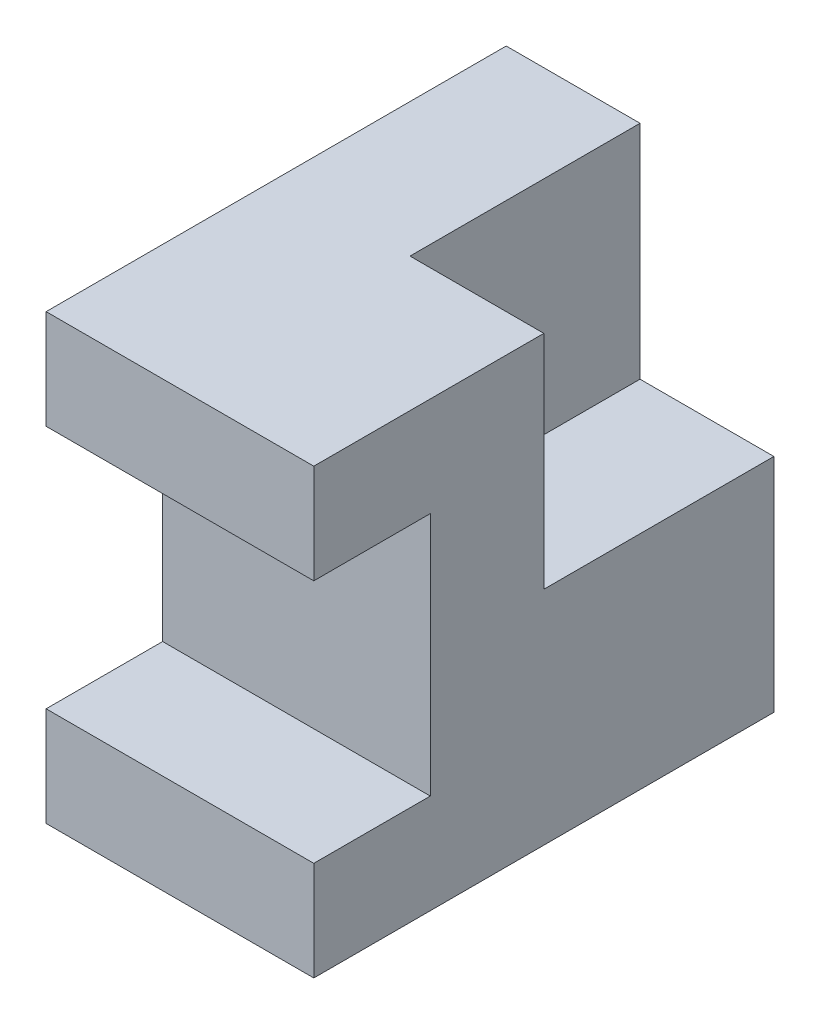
ISO-10303-21;
HEADER;
FILE_DESCRIPTION(('STEP AP214'),'2;1');
FILE_NAME('part.step','',(''),(''),'','','');
FILE_SCHEMA(('AUTOMOTIVE_DESIGN { 1 0 10303 214 1 1 1 1 }'));
ENDSEC;
DATA;
#1=APPLICATION_CONTEXT('core data for automotive mechanical design processes');
#2=APPLICATION_PROTOCOL_DEFINITION('international standard','automotive_design',2000,#1);
#3=PRODUCT_CONTEXT('',#1,'mechanical');
#4=PRODUCT('Part','Part','',(#3));
#5=PRODUCT_RELATED_PRODUCT_CATEGORY('part','',(#4));
#6=PRODUCT_DEFINITION_FORMATION('','',#4);
#7=PRODUCT_DEFINITION_CONTEXT('part definition',#1,'design');
#8=PRODUCT_DEFINITION('design','',#6,#7);
#9=PRODUCT_DEFINITION_SHAPE('','',#8);
#10=(LENGTH_UNIT() NAMED_UNIT(*) SI_UNIT(.MILLI.,.METRE.));
#11=(NAMED_UNIT(*) PLANE_ANGLE_UNIT() SI_UNIT($,.RADIAN.));
#12=(NAMED_UNIT(*) SI_UNIT($,.STERADIAN.) SOLID_ANGLE_UNIT());
#13=UNCERTAINTY_MEASURE_WITH_UNIT(LENGTH_MEASURE(1.E-05),#10,'distance_accuracy_value','');
#14=(GEOMETRIC_REPRESENTATION_CONTEXT(3) GLOBAL_UNCERTAINTY_ASSIGNED_CONTEXT((#13)) GLOBAL_UNIT_ASSIGNED_CONTEXT((#10,
#11,#12)) REPRESENTATION_CONTEXT('',''));
#15=CARTESIAN_POINT('',(0.,0.,0.));
#16=DIRECTION('',(0.,0.,1.));
#17=DIRECTION('',(1.,0.,0.));
#18=AXIS2_PLACEMENT_3D('',#15,#16,#17);
#19=CARTESIAN_POINT('',(-30.,24.8404474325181,13.0579168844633));
#20=DIRECTION('',(0.,1.,0.));
#21=DIRECTION('',(0.,0.,1.));
#22=AXIS2_PLACEMENT_3D('',#19,#20,#21);
#23=PLANE('',#22);
#24=DIRECTION('',(1.,0.,0.));
#25=VECTOR('',#24,1.);
#26=CARTESIAN_POINT('',(15.,24.8404474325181,-12.7256740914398));
#27=LINE('',#26,#25);
#28=CARTESIAN_POINT('',(-15.,24.8404474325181,-12.7256740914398));
#29=VERTEX_POINT('',#28);
#30=CARTESIAN_POINT('',(0.,24.8404474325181,-12.7256740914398));
#31=VERTEX_POINT('',#30);
#32=EDGE_CURVE('E185',#29,#31,#27,.T.);
#33=ORIENTED_EDGE('',*,*,#32,.F.);
#34=DIRECTION('',(0.,0.,1.));
#35=VECTOR('',#34,1.);
#36=CARTESIAN_POINT('',(-15.,24.8404474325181,-64.292856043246));
#37=LINE('',#36,#35);
#38=CARTESIAN_POINT('',(-15.,24.8404474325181,-38.5092650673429));
#39=VERTEX_POINT('',#38);
#40=EDGE_CURVE('E253',#39,#29,#37,.T.);
#41=ORIENTED_EDGE('',*,*,#40,.F.);
#42=DIRECTION('',(1.,0.,0.));
#43=VECTOR('',#42,1.);
#44=CARTESIAN_POINT('',(-30.,24.8404474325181,-38.5092650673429));
#45=LINE('',#44,#43);
#46=CARTESIAN_POINT('',(-30.,24.8404474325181,-38.5092650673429));
#47=VERTEX_POINT('',#46);
#48=EDGE_CURVE('E171',#47,#39,#45,.T.);
#49=ORIENTED_EDGE('',*,*,#48,.F.);
#50=DIRECTION('',(0.,0.,1.));
#51=VECTOR('',#50,1.);
#52=CARTESIAN_POINT('',(-30.,24.8404474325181,13.0579168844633));
#53=LINE('',#52,#51);
#54=CARTESIAN_POINT('',(-30.,24.8404474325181,13.0579168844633));
#55=VERTEX_POINT('',#54);
#56=EDGE_CURVE('E137',#47,#55,#53,.T.);
#57=ORIENTED_EDGE('',*,*,#56,.T.);
#58=DIRECTION('',(1.,0.,0.));
#59=VECTOR('',#58,1.);
#60=CARTESIAN_POINT('',(-30.,24.8404474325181,13.0579168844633));
#61=LINE('',#60,#59);
#62=CARTESIAN_POINT('',(0.,24.8404474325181,13.0579168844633));
#63=VERTEX_POINT('',#62);
#64=EDGE_CURVE('E168',#55,#63,#61,.T.);
#65=ORIENTED_EDGE('',*,*,#64,.T.);
#66=DIRECTION('',(0.,0.,1.));
#67=VECTOR('',#66,1.);
#68=CARTESIAN_POINT('',(0.,24.8404474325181,13.0579168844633));
#69=LINE('',#68,#67);
#70=EDGE_CURVE('E152',#31,#63,#69,.T.);
#71=ORIENTED_EDGE('',*,*,#70,.F.);
#72=EDGE_LOOP('',(#33,#41,#49,#57,#65,#71));
#73=FACE_BOUND('',#72,.T.);
#74=ADVANCED_FACE('F33',(#73),#23,.T.);
#75=CARTESIAN_POINT('',(-30.,-24.8404474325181,-38.5092650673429));
#76=DIRECTION('',(0.,0.,-1.));
#77=DIRECTION('',(0.,1.,0.));
#78=AXIS2_PLACEMENT_3D('',#75,#76,#77);
#79=PLANE('',#78);
#80=ORIENTED_EDGE('',*,*,#48,.T.);
#81=DIRECTION('',(0.,-1.,0.));
#82=VECTOR('',#81,1.);
#83=CARTESIAN_POINT('',(-15.,-24.8404474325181,-38.5092650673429));
#84=LINE('',#83,#82);
#85=CARTESIAN_POINT('',(-15.,0.,-38.5092650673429));
#86=VERTEX_POINT('',#85);
#87=EDGE_CURVE('E11',#39,#86,#84,.T.);
#88=ORIENTED_EDGE('',*,*,#87,.T.);
#89=DIRECTION('',(-1.,0.,0.));
#90=VECTOR('',#89,1.);
#91=CARTESIAN_POINT('',(-30.,0.,-38.5092650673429));
#92=LINE('',#91,#90);
#93=CARTESIAN_POINT('',(0.,0.,-38.5092650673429));
#94=VERTEX_POINT('',#93);
#95=EDGE_CURVE('E146',#94,#86,#92,.T.);
#96=ORIENTED_EDGE('',*,*,#95,.F.);
#97=DIRECTION('',(0.,1.,0.));
#98=VECTOR('',#97,1.);
#99=CARTESIAN_POINT('',(0.,-24.8404474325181,-38.5092650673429));
#100=LINE('',#99,#98);
#101=CARTESIAN_POINT('',(0.,-24.8404474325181,-38.5092650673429));
#102=VERTEX_POINT('',#101);
#103=EDGE_CURVE('E149',#102,#94,#100,.T.);
#104=ORIENTED_EDGE('',*,*,#103,.F.);
#105=DIRECTION('',(1.,0.,0.));
#106=VECTOR('',#105,1.);
#107=CARTESIAN_POINT('',(-30.,-24.8404474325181,-38.5092650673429));
#108=LINE('',#107,#106);
#109=CARTESIAN_POINT('',(-30.,-24.8404474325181,-38.5092650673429));
#110=VERTEX_POINT('',#109);
#111=EDGE_CURVE('E174',#110,#102,#108,.T.);
#112=ORIENTED_EDGE('',*,*,#111,.F.);
#113=DIRECTION('',(0.,1.,0.));
#114=VECTOR('',#113,1.);
#115=CARTESIAN_POINT('',(-30.,-24.8404474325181,-38.5092650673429));
#116=LINE('',#115,#114);
#117=EDGE_CURVE('E210',#110,#47,#116,.T.);
#118=ORIENTED_EDGE('',*,*,#117,.T.);
#119=EDGE_LOOP('',(#80,#88,#96,#104,#112,#118));
#120=FACE_BOUND('',#119,.T.);
#121=ADVANCED_FACE('F199',(#120),#79,.T.);
#122=CARTESIAN_POINT('',(0.,-13.7091045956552,13.0579168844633));
#123=DIRECTION('',(-1.,0.,0.));
#124=DIRECTION('',(0.,0.,1.));
#125=AXIS2_PLACEMENT_3D('',#122,#123,#124);
#126=PLANE('',#125);
#127=DIRECTION('',(0.,-1.,0.));
#128=VECTOR('',#127,1.);
#129=CARTESIAN_POINT('',(0.,-13.7091045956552,-12.7256740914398));
#130=LINE('',#129,#128);
#131=CARTESIAN_POINT('',(0.,0.,-12.7256740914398));
#132=VERTEX_POINT('',#131);
#133=EDGE_CURVE('E41',#31,#132,#130,.T.);
#134=ORIENTED_EDGE('',*,*,#133,.F.);
#135=ORIENTED_EDGE('',*,*,#70,.T.);
#136=DIRECTION('',(0.,-1.,0.));
#137=VECTOR('',#136,1.);
#138=CARTESIAN_POINT('',(0.,13.7091045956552,13.0579168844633));
#139=LINE('',#138,#137);
#140=CARTESIAN_POINT('',(0.,13.7091045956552,13.0579168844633));
#141=VERTEX_POINT('',#140);
#142=EDGE_CURVE('E154',#63,#141,#139,.T.);
#143=ORIENTED_EDGE('',*,*,#142,.T.);
#144=DIRECTION('',(0.,0.,-1.));
#145=VECTOR('',#144,1.);
#146=CARTESIAN_POINT('',(0.,13.7091045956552,13.0579168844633));
#147=LINE('',#146,#145);
#148=CARTESIAN_POINT('',(0.,13.7091045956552,0.));
#149=VERTEX_POINT('',#148);
#150=EDGE_CURVE('E157',#141,#149,#147,.T.);
#151=ORIENTED_EDGE('',*,*,#150,.T.);
#152=DIRECTION('',(0.,-1.,0.));
#153=VECTOR('',#152,1.);
#154=CARTESIAN_POINT('',(0.,-13.7091045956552,0.));
#155=LINE('',#154,#153);
#156=CARTESIAN_POINT('',(0.,-13.7091045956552,0.));
#157=VERTEX_POINT('',#156);
#158=EDGE_CURVE('E118',#149,#157,#155,.T.);
#159=ORIENTED_EDGE('',*,*,#158,.T.);
#160=DIRECTION('',(0.,0.,1.));
#161=VECTOR('',#160,1.);
#162=CARTESIAN_POINT('',(0.,-13.7091045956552,13.0579168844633));
#163=LINE('',#162,#161);
#164=CARTESIAN_POINT('',(0.,-13.7091045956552,13.0579168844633));
#165=VERTEX_POINT('',#164);
#166=EDGE_CURVE('E160',#157,#165,#163,.T.);
#167=ORIENTED_EDGE('',*,*,#166,.T.);
#168=DIRECTION('',(0.,-1.,0.));
#169=VECTOR('',#168,1.);
#170=CARTESIAN_POINT('',(0.,-24.8404474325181,13.0579168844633));
#171=LINE('',#170,#169);
#172=CARTESIAN_POINT('',(0.,-24.8404474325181,13.0579168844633));
#173=VERTEX_POINT('',#172);
#174=EDGE_CURVE('E142',#165,#173,#171,.T.);
#175=ORIENTED_EDGE('',*,*,#174,.T.);
#176=DIRECTION('',(0.,0.,-1.));
#177=VECTOR('',#176,1.);
#178=CARTESIAN_POINT('',(0.,-24.8404474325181,13.0579168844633));
#179=LINE('',#178,#177);
#180=EDGE_CURVE('E145',#173,#102,#179,.T.);
#181=ORIENTED_EDGE('',*,*,#180,.T.);
#182=ORIENTED_EDGE('',*,*,#103,.T.);
#183=DIRECTION('',(0.,0.,1.));
#184=VECTOR('',#183,1.);
#185=CARTESIAN_POINT('',(0.,0.,13.0579168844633));
#186=LINE('',#185,#184);
#187=EDGE_CURVE('E165',#94,#132,#186,.T.);
#188=ORIENTED_EDGE('',*,*,#187,.T.);
#189=EDGE_LOOP('',(#134,#135,#143,#151,#159,#167,#175,#181,#182,#188));
#190=FACE_BOUND('',#189,.T.);
#191=ADVANCED_FACE('F188',(#190),#126,.F.);
#192=CARTESIAN_POINT('',(-30.,-24.8404474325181,13.0579168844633));
#193=DIRECTION('',(0.,0.,1.));
#194=DIRECTION('',(1.,0.,0.));
#195=AXIS2_PLACEMENT_3D('',#192,#193,#194);
#196=PLANE('',#195);
#197=ORIENTED_EDGE('',*,*,#174,.F.);
#198=DIRECTION('',(1.,0.,0.));
#199=VECTOR('',#198,1.);
#200=CARTESIAN_POINT('',(-30.,-13.7091045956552,13.0579168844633));
#201=LINE('',#200,#199);
#202=CARTESIAN_POINT('',(-30.,-13.7091045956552,13.0579168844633));
#203=VERTEX_POINT('',#202);
#204=EDGE_CURVE('E57',#203,#165,#201,.T.);
#205=ORIENTED_EDGE('',*,*,#204,.F.);
#206=DIRECTION('',(0.,-1.,0.));
#207=VECTOR('',#206,1.);
#208=CARTESIAN_POINT('',(-30.,-24.8404474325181,13.0579168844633));
#209=LINE('',#208,#207);
#210=CARTESIAN_POINT('',(-30.,-24.8404474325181,13.0579168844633));
#211=VERTEX_POINT('',#210);
#212=EDGE_CURVE('E163',#203,#211,#209,.T.);
#213=ORIENTED_EDGE('',*,*,#212,.T.);
#214=DIRECTION('',(1.,0.,0.));
#215=VECTOR('',#214,1.);
#216=CARTESIAN_POINT('',(-30.,-24.8404474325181,13.0579168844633));
#217=LINE('',#216,#215);
#218=EDGE_CURVE('E93',#211,#173,#217,.T.);
#219=ORIENTED_EDGE('',*,*,#218,.T.);
#220=EDGE_LOOP('',(#197,#205,#213,#219));
#221=FACE_BOUND('',#220,.T.);
#222=ADVANCED_FACE('F35',(#221),#196,.T.);
#223=CARTESIAN_POINT('',(-30.,-13.7091045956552,13.0579168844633));
#224=DIRECTION('',(0.,1.,0.));
#225=DIRECTION('',(0.,0.,1.));
#226=AXIS2_PLACEMENT_3D('',#223,#224,#225);
#227=PLANE('',#226);
#228=ORIENTED_EDGE('',*,*,#166,.F.);
#229=DIRECTION('',(1.,0.,0.));
#230=VECTOR('',#229,1.);
#231=CARTESIAN_POINT('',(-30.,-13.7091045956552,0.));
#232=LINE('',#231,#230);
#233=CARTESIAN_POINT('',(-30.,-13.7091045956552,0.));
#234=VERTEX_POINT('',#233);
#235=EDGE_CURVE('E123',#234,#157,#232,.T.);
#236=ORIENTED_EDGE('',*,*,#235,.F.);
#237=DIRECTION('',(0.,0.,1.));
#238=VECTOR('',#237,1.);
#239=CARTESIAN_POINT('',(-30.,-13.7091045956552,13.0579168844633));
#240=LINE('',#239,#238);
#241=EDGE_CURVE('E132',#234,#203,#240,.T.);
#242=ORIENTED_EDGE('',*,*,#241,.T.);
#243=ORIENTED_EDGE('',*,*,#204,.T.);
#244=EDGE_LOOP('',(#228,#236,#242,#243));
#245=FACE_BOUND('',#244,.T.);
#246=ADVANCED_FACE('F219',(#245),#227,.T.);
#247=CARTESIAN_POINT('',(-30.,-13.7091045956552,0.));
#248=DIRECTION('',(0.,0.,1.));
#249=DIRECTION('',(1.,0.,0.));
#250=AXIS2_PLACEMENT_3D('',#247,#248,#249);
#251=PLANE('',#250);
#252=ORIENTED_EDGE('',*,*,#158,.F.);
#253=DIRECTION('',(1.,0.,0.));
#254=VECTOR('',#253,1.);
#255=CARTESIAN_POINT('',(-30.,13.7091045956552,0.));
#256=LINE('',#255,#254);
#257=CARTESIAN_POINT('',(-30.,13.7091045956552,0.));
#258=VERTEX_POINT('',#257);
#259=EDGE_CURVE('E112',#258,#149,#256,.T.);
#260=ORIENTED_EDGE('',*,*,#259,.F.);
#261=DIRECTION('',(0.,-1.,0.));
#262=VECTOR('',#261,1.);
#263=CARTESIAN_POINT('',(-30.,-13.7091045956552,0.));
#264=LINE('',#263,#262);
#265=EDGE_CURVE('E115',#258,#234,#264,.T.);
#266=ORIENTED_EDGE('',*,*,#265,.T.);
#267=ORIENTED_EDGE('',*,*,#235,.T.);
#268=EDGE_LOOP('',(#252,#260,#266,#267));
#269=FACE_BOUND('',#268,.T.);
#270=ADVANCED_FACE('F114',(#269),#251,.T.);
#271=CARTESIAN_POINT('',(-30.,13.7091045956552,13.0579168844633));
#272=DIRECTION('',(0.,-1.,0.));
#273=DIRECTION('',(0.,0.,-1.));
#274=AXIS2_PLACEMENT_3D('',#271,#272,#273);
#275=PLANE('',#274);
#276=ORIENTED_EDGE('',*,*,#150,.F.);
#277=DIRECTION('',(1.,0.,0.));
#278=VECTOR('',#277,1.);
#279=CARTESIAN_POINT('',(-30.,13.7091045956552,13.0579168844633));
#280=LINE('',#279,#278);
#281=CARTESIAN_POINT('',(-30.,13.7091045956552,13.0579168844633));
#282=VERTEX_POINT('',#281);
#283=EDGE_CURVE('E124',#282,#141,#280,.T.);
#284=ORIENTED_EDGE('',*,*,#283,.F.);
#285=DIRECTION('',(0.,0.,-1.));
#286=VECTOR('',#285,1.);
#287=CARTESIAN_POINT('',(-30.,13.7091045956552,13.0579168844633));
#288=LINE('',#287,#286);
#289=EDGE_CURVE('E130',#282,#258,#288,.T.);
#290=ORIENTED_EDGE('',*,*,#289,.T.);
#291=ORIENTED_EDGE('',*,*,#259,.T.);
#292=EDGE_LOOP('',(#276,#284,#290,#291));
#293=FACE_BOUND('',#292,.T.);
#294=ADVANCED_FACE('F134',(#293),#275,.T.);
#295=CARTESIAN_POINT('',(-30.,13.7091045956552,13.0579168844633));
#296=DIRECTION('',(0.,0.,1.));
#297=DIRECTION('',(1.,0.,0.));
#298=AXIS2_PLACEMENT_3D('',#295,#296,#297);
#299=PLANE('',#298);
#300=ORIENTED_EDGE('',*,*,#142,.F.);
#301=ORIENTED_EDGE('',*,*,#64,.F.);
#302=DIRECTION('',(0.,-1.,0.));
#303=VECTOR('',#302,1.);
#304=CARTESIAN_POINT('',(-30.,13.7091045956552,13.0579168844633));
#305=LINE('',#304,#303);
#306=EDGE_CURVE('E135',#55,#282,#305,.T.);
#307=ORIENTED_EDGE('',*,*,#306,.T.);
#308=ORIENTED_EDGE('',*,*,#283,.T.);
#309=EDGE_LOOP('',(#300,#301,#307,#308));
#310=FACE_BOUND('',#309,.T.);
#311=ADVANCED_FACE('F235',(#310),#299,.T.);
#312=CARTESIAN_POINT('',(-30.,-24.8404474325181,13.0579168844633));
#313=DIRECTION('',(0.,-1.,0.));
#314=DIRECTION('',(0.,0.,-1.));
#315=AXIS2_PLACEMENT_3D('',#312,#313,#314);
#316=PLANE('',#315);
#317=ORIENTED_EDGE('',*,*,#180,.F.);
#318=ORIENTED_EDGE('',*,*,#218,.F.);
#319=DIRECTION('',(0.,0.,-1.));
#320=VECTOR('',#319,1.);
#321=CARTESIAN_POINT('',(-30.,-24.8404474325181,13.0579168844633));
#322=LINE('',#321,#320);
#323=EDGE_CURVE('E208',#211,#110,#322,.T.);
#324=ORIENTED_EDGE('',*,*,#323,.T.);
#325=ORIENTED_EDGE('',*,*,#111,.T.);
#326=EDGE_LOOP('',(#317,#318,#324,#325));
#327=FACE_BOUND('',#326,.T.);
#328=ADVANCED_FACE('F218',(#327),#316,.T.);
#329=CARTESIAN_POINT('',(-30.,-13.7091045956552,13.0579168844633));
#330=DIRECTION('',(-1.,0.,0.));
#331=DIRECTION('',(0.,0.,1.));
#332=AXIS2_PLACEMENT_3D('',#329,#330,#331);
#333=PLANE('',#332);
#334=ORIENTED_EDGE('',*,*,#212,.F.);
#335=ORIENTED_EDGE('',*,*,#241,.F.);
#336=ORIENTED_EDGE('',*,*,#265,.F.);
#337=ORIENTED_EDGE('',*,*,#289,.F.);
#338=ORIENTED_EDGE('',*,*,#306,.F.);
#339=ORIENTED_EDGE('',*,*,#56,.F.);
#340=ORIENTED_EDGE('',*,*,#117,.F.);
#341=ORIENTED_EDGE('',*,*,#323,.F.);
#342=EDGE_LOOP('',(#334,#335,#336,#337,#338,#339,#340,#341));
#343=FACE_BOUND('',#342,.T.);
#344=ADVANCED_FACE('F128',(#343),#333,.T.);
#345=CARTESIAN_POINT('',(15.,24.8404474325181,-12.7256740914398));
#346=DIRECTION('',(0.,0.,-1.));
#347=DIRECTION('',(-1.,0.,0.));
#348=AXIS2_PLACEMENT_3D('',#345,#346,#347);
#349=PLANE('',#348);
#350=ORIENTED_EDGE('',*,*,#133,.T.);
#351=DIRECTION('',(1.,0.,0.));
#352=VECTOR('',#351,1.);
#353=CARTESIAN_POINT('',(15.,0.,-12.7256740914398));
#354=LINE('',#353,#352);
#355=CARTESIAN_POINT('',(-15.,0.,-12.7256740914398));
#356=VERTEX_POINT('',#355);
#357=EDGE_CURVE('E48',#356,#132,#354,.T.);
#358=ORIENTED_EDGE('',*,*,#357,.F.);
#359=DIRECTION('',(0.,-1.,0.));
#360=VECTOR('',#359,1.);
#361=CARTESIAN_POINT('',(-15.,24.8404474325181,-12.7256740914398));
#362=LINE('',#361,#360);
#363=EDGE_CURVE('E201',#29,#356,#362,.T.);
#364=ORIENTED_EDGE('',*,*,#363,.F.);
#365=ORIENTED_EDGE('',*,*,#32,.T.);
#366=EDGE_LOOP('',(#350,#358,#364,#365));
#367=FACE_BOUND('',#366,.T.);
#368=ADVANCED_FACE('F181',(#367),#349,.T.);
#369=CARTESIAN_POINT('',(-15.,24.8404474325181,-64.292856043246));
#370=DIRECTION('',(1.,0.,0.));
#371=DIRECTION('',(0.,0.,-1.));
#372=AXIS2_PLACEMENT_3D('',#369,#370,#371);
#373=PLANE('',#372);
#374=ORIENTED_EDGE('',*,*,#40,.T.);
#375=ORIENTED_EDGE('',*,*,#363,.T.);
#376=DIRECTION('',(0.,0.,1.));
#377=VECTOR('',#376,1.);
#378=CARTESIAN_POINT('',(-15.,0.,-64.292856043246));
#379=LINE('',#378,#377);
#380=EDGE_CURVE('E257',#86,#356,#379,.T.);
#381=ORIENTED_EDGE('',*,*,#380,.F.);
#382=ORIENTED_EDGE('',*,*,#87,.F.);
#383=EDGE_LOOP('',(#374,#375,#381,#382));
#384=FACE_BOUND('',#383,.T.);
#385=ADVANCED_FACE('F254',(#384),#373,.T.);
#386=CARTESIAN_POINT('',(15.,0.,-12.7256740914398));
#387=DIRECTION('',(0.,-1.,0.));
#388=DIRECTION('',(0.,0.,-1.));
#389=AXIS2_PLACEMENT_3D('',#386,#387,#388);
#390=PLANE('',#389);
#391=ORIENTED_EDGE('',*,*,#95,.T.);
#392=ORIENTED_EDGE('',*,*,#380,.T.);
#393=ORIENTED_EDGE('',*,*,#357,.T.);
#394=ORIENTED_EDGE('',*,*,#187,.F.);
#395=EDGE_LOOP('',(#391,#392,#393,#394));
#396=FACE_BOUND('',#395,.T.);
#397=ADVANCED_FACE('F193',(#396),#390,.F.);
#398=CLOSED_SHELL('',(#74,#121,#191,#222,#246,#270,#294,#311,#328,#344,#368,#385,#397));
#399=MANIFOLD_SOLID_BREP('B2',#398);
#400=ADVANCED_BREP_SHAPE_REPRESENTATION('',(#18,#399),#14);
#401=SHAPE_DEFINITION_REPRESENTATION(#9,#400);
ENDSEC;
END-ISO-10303-21;
